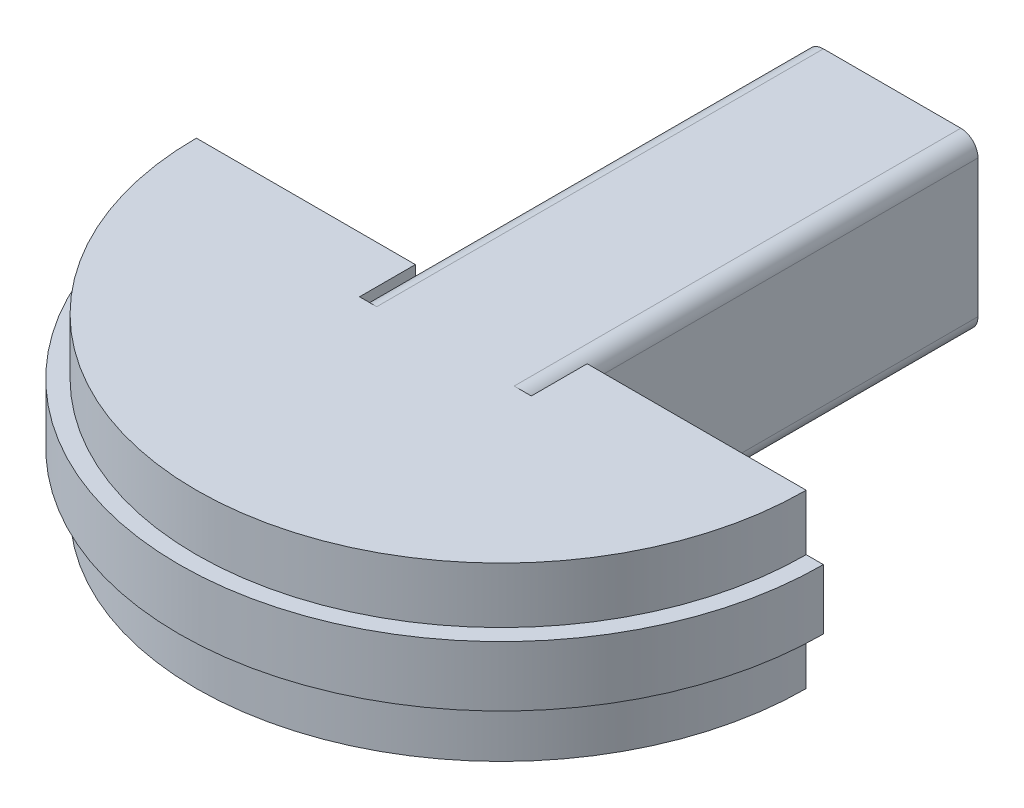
ISO-10303-21;
HEADER;
FILE_DESCRIPTION(('STEP AP214'),'2;1');
FILE_NAME('part.step','',(''),(''),'','','');
FILE_SCHEMA(('AUTOMOTIVE_DESIGN { 1 0 10303 214 1 1 1 1 }'));
ENDSEC;
DATA;
#1=APPLICATION_CONTEXT('core data for automotive mechanical design processes');
#2=APPLICATION_PROTOCOL_DEFINITION('international standard','automotive_design',2000,#1);
#3=PRODUCT_CONTEXT('',#1,'mechanical');
#4=PRODUCT('Part','Part','',(#3));
#5=PRODUCT_RELATED_PRODUCT_CATEGORY('part','',(#4));
#6=PRODUCT_DEFINITION_FORMATION('','',#4);
#7=PRODUCT_DEFINITION_CONTEXT('part definition',#1,'design');
#8=PRODUCT_DEFINITION('design','',#6,#7);
#9=PRODUCT_DEFINITION_SHAPE('','',#8);
#10=(LENGTH_UNIT() NAMED_UNIT(*) SI_UNIT(.MILLI.,.METRE.));
#11=(NAMED_UNIT(*) PLANE_ANGLE_UNIT() SI_UNIT($,.RADIAN.));
#12=(NAMED_UNIT(*) SI_UNIT($,.STERADIAN.) SOLID_ANGLE_UNIT());
#13=UNCERTAINTY_MEASURE_WITH_UNIT(LENGTH_MEASURE(1.E-05),#10,'distance_accuracy_value','');
#14=(GEOMETRIC_REPRESENTATION_CONTEXT(3) GLOBAL_UNCERTAINTY_ASSIGNED_CONTEXT((#13)) GLOBAL_UNIT_ASSIGNED_CONTEXT((#10,
#11,#12)) REPRESENTATION_CONTEXT('',''));
#15=CARTESIAN_POINT('',(0.,0.,0.));
#16=DIRECTION('',(0.,0.,1.));
#17=DIRECTION('',(1.,0.,0.));
#18=AXIS2_PLACEMENT_3D('',#15,#16,#17);
#19=CARTESIAN_POINT('',(0.,10.,45.5));
#20=DIRECTION('',(0.,-1.,0.));
#21=DIRECTION('',(0.,0.,1.));
#22=AXIS2_PLACEMENT_3D('',#19,#20,#21);
#23=CYLINDRICAL_SURFACE('',#22,35.5);
#24=CARTESIAN_POINT('',(0.,-3.5,45.5));
#25=DIRECTION('',(0.,-1.,0.));
#26=DIRECTION('',(0.,0.,-1.));
#27=AXIS2_PLACEMENT_3D('',#24,#25,#26);
#28=CIRCLE('',#27,35.5);
#29=CARTESIAN_POINT('',(35.5,-3.5,45.5));
#30=VERTEX_POINT('',#29);
#31=CARTESIAN_POINT('',(-35.5,-3.5,45.5));
#32=VERTEX_POINT('',#31);
#33=EDGE_CURVE('E29',#30,#32,#28,.T.);
#34=ORIENTED_EDGE('',*,*,#33,.T.);
#35=DIRECTION('',(0.,-1.,0.));
#36=VECTOR('',#35,1.);
#37=CARTESIAN_POINT('',(-35.5,10.,45.5));
#38=LINE('',#37,#36);
#39=CARTESIAN_POINT('',(-35.5,-10.,45.5));
#40=VERTEX_POINT('',#39);
#41=EDGE_CURVE('E259',#32,#40,#38,.T.);
#42=ORIENTED_EDGE('',*,*,#41,.T.);
#43=CARTESIAN_POINT('',(0.,-10.,45.5));
#44=DIRECTION('',(0.,1.,0.));
#45=DIRECTION('',(0.,0.,-1.));
#46=AXIS2_PLACEMENT_3D('',#43,#44,#45);
#47=CIRCLE('',#46,35.5);
#48=CARTESIAN_POINT('',(35.5,-10.,45.5));
#49=VERTEX_POINT('',#48);
#50=EDGE_CURVE('E232',#40,#49,#47,.T.);
#51=ORIENTED_EDGE('',*,*,#50,.T.);
#52=DIRECTION('',(0.,-1.,0.));
#53=VECTOR('',#52,1.);
#54=CARTESIAN_POINT('',(35.5,10.,45.5));
#55=LINE('',#54,#53);
#56=EDGE_CURVE('E255',#30,#49,#55,.T.);
#57=ORIENTED_EDGE('',*,*,#56,.F.);
#58=EDGE_LOOP('',(#34,#42,#51,#57));
#59=FACE_BOUND('',#58,.T.);
#60=ADVANCED_FACE('F14',(#59),#23,.T.);
#61=CARTESIAN_POINT('',(10.,-10.,52.));
#62=DIRECTION('',(-1.,0.,0.));
#63=DIRECTION('',(0.,0.,1.));
#64=AXIS2_PLACEMENT_3D('',#61,#62,#63);
#65=PLANE('',#64);
#66=DIRECTION('',(0.,-1.,0.));
#67=VECTOR('',#66,1.);
#68=CARTESIAN_POINT('',(10.,10.,45.5));
#69=LINE('',#68,#67);
#70=CARTESIAN_POINT('',(10.,8.,45.5));
#71=VERTEX_POINT('',#70);
#72=CARTESIAN_POINT('',(10.,-8.,45.5));
#73=VERTEX_POINT('',#72);
#74=EDGE_CURVE('E37',#71,#73,#69,.T.);
#75=ORIENTED_EDGE('',*,*,#74,.T.);
#76=DIRECTION('',(0.,0.,-1.));
#77=VECTOR('',#76,1.);
#78=CARTESIAN_POINT('',(10.,-8.,52.));
#79=LINE('',#78,#77);
#80=CARTESIAN_POINT('',(10.,-8.,0.));
#81=VERTEX_POINT('',#80);
#82=EDGE_CURVE('E157',#73,#81,#79,.T.);
#83=ORIENTED_EDGE('',*,*,#82,.T.);
#84=DIRECTION('',(0.,-1.,0.));
#85=VECTOR('',#84,1.);
#86=CARTESIAN_POINT('',(10.,8.,0.));
#87=LINE('',#86,#85);
#88=CARTESIAN_POINT('',(10.,8.,0.));
#89=VERTEX_POINT('',#88);
#90=EDGE_CURVE('E160',#89,#81,#87,.T.);
#91=ORIENTED_EDGE('',*,*,#90,.F.);
#92=DIRECTION('',(0.,0.,-1.));
#93=VECTOR('',#92,1.);
#94=CARTESIAN_POINT('',(10.,8.,52.));
#95=LINE('',#94,#93);
#96=EDGE_CURVE('E151',#89,#71,#95,.F.);
#97=ORIENTED_EDGE('',*,*,#96,.T.);
#98=EDGE_LOOP('',(#75,#83,#91,#97));
#99=FACE_BOUND('',#98,.T.);
#100=ADVANCED_FACE('F161',(#99),#65,.F.);
#101=CARTESIAN_POINT('',(-10.,-10.,52.));
#102=DIRECTION('',(1.,0.,0.));
#103=DIRECTION('',(0.,0.,-1.));
#104=AXIS2_PLACEMENT_3D('',#101,#102,#103);
#105=PLANE('',#104);
#106=DIRECTION('',(0.,-1.,0.));
#107=VECTOR('',#106,1.);
#108=CARTESIAN_POINT('',(-10.,10.,45.5));
#109=LINE('',#108,#107);
#110=CARTESIAN_POINT('',(-10.,8.,45.5));
#111=VERTEX_POINT('',#110);
#112=CARTESIAN_POINT('',(-10.,-8.,45.5));
#113=VERTEX_POINT('',#112);
#114=EDGE_CURVE('E268',#111,#113,#109,.T.);
#115=ORIENTED_EDGE('',*,*,#114,.F.);
#116=DIRECTION('',(0.,0.,-1.));
#117=VECTOR('',#116,1.);
#118=CARTESIAN_POINT('',(-10.,8.,52.));
#119=LINE('',#118,#117);
#120=CARTESIAN_POINT('',(-10.,8.,0.));
#121=VERTEX_POINT('',#120);
#122=EDGE_CURVE('E290',#111,#121,#119,.T.);
#123=ORIENTED_EDGE('',*,*,#122,.T.);
#124=DIRECTION('',(0.,1.,0.));
#125=VECTOR('',#124,1.);
#126=CARTESIAN_POINT('',(-10.,-8.,0.));
#127=LINE('',#126,#125);
#128=CARTESIAN_POINT('',(-10.,-8.,0.));
#129=VERTEX_POINT('',#128);
#130=EDGE_CURVE('E181',#129,#121,#127,.T.);
#131=ORIENTED_EDGE('',*,*,#130,.F.);
#132=DIRECTION('',(0.,0.,-1.));
#133=VECTOR('',#132,1.);
#134=CARTESIAN_POINT('',(-10.,-8.,52.));
#135=LINE('',#134,#133);
#136=EDGE_CURVE('E294',#129,#113,#135,.F.);
#137=ORIENTED_EDGE('',*,*,#136,.T.);
#138=EDGE_LOOP('',(#115,#123,#131,#137));
#139=FACE_BOUND('',#138,.T.);
#140=ADVANCED_FACE('F341',(#139),#105,.F.);
#141=CARTESIAN_POINT('',(10.,10.,52.));
#142=DIRECTION('',(0.,-1.,0.));
#143=DIRECTION('',(0.,0.,1.));
#144=AXIS2_PLACEMENT_3D('',#141,#142,#143);
#145=PLANE('',#144);
#146=DIRECTION('',(0.,0.,-1.));
#147=VECTOR('',#146,1.);
#148=CARTESIAN_POINT('',(8.,10.,52.));
#149=LINE('',#148,#147);
#150=CARTESIAN_POINT('',(8.,10.,52.));
#151=VERTEX_POINT('',#150);
#152=CARTESIAN_POINT('',(8.,10.,0.));
#153=VERTEX_POINT('',#152);
#154=EDGE_CURVE('E22',#151,#153,#149,.T.);
#155=ORIENTED_EDGE('',*,*,#154,.T.);
#156=DIRECTION('',(1.,0.,0.));
#157=VECTOR('',#156,1.);
#158=CARTESIAN_POINT('',(-8.,10.,0.));
#159=LINE('',#158,#157);
#160=CARTESIAN_POINT('',(-8.,10.,0.));
#161=VERTEX_POINT('',#160);
#162=EDGE_CURVE('E171',#161,#153,#159,.T.);
#163=ORIENTED_EDGE('',*,*,#162,.F.);
#164=DIRECTION('',(0.,0.,-1.));
#165=VECTOR('',#164,1.);
#166=CARTESIAN_POINT('',(-8.,10.,52.));
#167=LINE('',#166,#165);
#168=CARTESIAN_POINT('',(-8.,10.,52.));
#169=VERTEX_POINT('',#168);
#170=EDGE_CURVE('E9',#161,#169,#167,.F.);
#171=ORIENTED_EDGE('',*,*,#170,.T.);
#172=DIRECTION('',(-1.,0.,0.));
#173=VECTOR('',#172,1.);
#174=CARTESIAN_POINT('',(10.,10.,52.));
#175=LINE('',#174,#173);
#176=CARTESIAN_POINT('',(-10.,10.,52.));
#177=VERTEX_POINT('',#176);
#178=EDGE_CURVE('E222',#169,#177,#175,.T.);
#179=ORIENTED_EDGE('',*,*,#178,.T.);
#180=DIRECTION('',(0.,0.,-1.));
#181=VECTOR('',#180,1.);
#182=CARTESIAN_POINT('',(-10.,10.,52.));
#183=LINE('',#182,#181);
#184=CARTESIAN_POINT('',(-10.,10.,45.5));
#185=VERTEX_POINT('',#184);
#186=EDGE_CURVE('E210',#177,#185,#183,.T.);
#187=ORIENTED_EDGE('',*,*,#186,.T.);
#188=DIRECTION('',(-1.,0.,0.));
#189=VECTOR('',#188,1.);
#190=CARTESIAN_POINT('',(-10.,10.,45.5));
#191=LINE('',#190,#189);
#192=CARTESIAN_POINT('',(-35.5,10.,45.5));
#193=VERTEX_POINT('',#192);
#194=EDGE_CURVE('E213',#185,#193,#191,.T.);
#195=ORIENTED_EDGE('',*,*,#194,.T.);
#196=CARTESIAN_POINT('',(0.,10.,45.5));
#197=DIRECTION('',(0.,1.,0.));
#198=DIRECTION('',(0.,0.,-1.));
#199=AXIS2_PLACEMENT_3D('',#196,#197,#198);
#200=CIRCLE('',#199,35.5);
#201=CARTESIAN_POINT('',(35.5,10.,45.5));
#202=VERTEX_POINT('',#201);
#203=EDGE_CURVE('E216',#193,#202,#200,.T.);
#204=ORIENTED_EDGE('',*,*,#203,.T.);
#205=DIRECTION('',(-1.,0.,0.));
#206=VECTOR('',#205,1.);
#207=CARTESIAN_POINT('',(10.,10.,45.5));
#208=LINE('',#207,#206);
#209=CARTESIAN_POINT('',(10.,10.,45.5));
#210=VERTEX_POINT('',#209);
#211=EDGE_CURVE('E218',#202,#210,#208,.T.);
#212=ORIENTED_EDGE('',*,*,#211,.T.);
#213=DIRECTION('',(0.,0.,1.));
#214=VECTOR('',#213,1.);
#215=CARTESIAN_POINT('',(10.,10.,52.));
#216=LINE('',#215,#214);
#217=CARTESIAN_POINT('',(10.,10.,52.));
#218=VERTEX_POINT('',#217);
#219=EDGE_CURVE('E220',#210,#218,#216,.T.);
#220=ORIENTED_EDGE('',*,*,#219,.T.);
#221=EDGE_CURVE('E223',#218,#151,#175,.T.);
#222=ORIENTED_EDGE('',*,*,#221,.T.);
#223=EDGE_LOOP('',(#155,#163,#171,#179,#187,#195,#204,#212,#220,#222));
#224=FACE_BOUND('',#223,.T.);
#225=ADVANCED_FACE('F297',(#224),#145,.F.);
#226=CARTESIAN_POINT('',(10.,-10.,52.));
#227=DIRECTION('',(0.,1.,0.));
#228=DIRECTION('',(1.,0.,0.));
#229=AXIS2_PLACEMENT_3D('',#226,#227,#228);
#230=PLANE('',#229);
#231=DIRECTION('',(0.,0.,-1.));
#232=VECTOR('',#231,1.);
#233=CARTESIAN_POINT('',(-8.,-10.,52.));
#234=LINE('',#233,#232);
#235=CARTESIAN_POINT('',(-8.,-10.,52.));
#236=VERTEX_POINT('',#235);
#237=CARTESIAN_POINT('',(-8.,-10.,0.));
#238=VERTEX_POINT('',#237);
#239=EDGE_CURVE('E274',#236,#238,#234,.T.);
#240=ORIENTED_EDGE('',*,*,#239,.T.);
#241=DIRECTION('',(-1.,0.,0.));
#242=VECTOR('',#241,1.);
#243=CARTESIAN_POINT('',(8.,-10.,0.));
#244=LINE('',#243,#242);
#245=CARTESIAN_POINT('',(8.,-10.,0.));
#246=VERTEX_POINT('',#245);
#247=EDGE_CURVE('E175',#246,#238,#244,.T.);
#248=ORIENTED_EDGE('',*,*,#247,.F.);
#249=DIRECTION('',(0.,0.,-1.));
#250=VECTOR('',#249,1.);
#251=CARTESIAN_POINT('',(8.,-10.,52.));
#252=LINE('',#251,#250);
#253=CARTESIAN_POINT('',(8.,-10.,52.));
#254=VERTEX_POINT('',#253);
#255=EDGE_CURVE('E276',#246,#254,#252,.F.);
#256=ORIENTED_EDGE('',*,*,#255,.T.);
#257=DIRECTION('',(-1.,0.,0.));
#258=VECTOR('',#257,1.);
#259=CARTESIAN_POINT('',(10.,-10.,52.));
#260=LINE('',#259,#258);
#261=CARTESIAN_POINT('',(10.,-10.,52.));
#262=VERTEX_POINT('',#261);
#263=EDGE_CURVE('E214',#262,#254,#260,.T.);
#264=ORIENTED_EDGE('',*,*,#263,.F.);
#265=DIRECTION('',(0.,0.,1.));
#266=VECTOR('',#265,1.);
#267=CARTESIAN_POINT('',(10.,-10.,52.));
#268=LINE('',#267,#266);
#269=CARTESIAN_POINT('',(10.,-10.,45.5));
#270=VERTEX_POINT('',#269);
#271=EDGE_CURVE('E238',#270,#262,#268,.T.);
#272=ORIENTED_EDGE('',*,*,#271,.F.);
#273=DIRECTION('',(-1.,0.,0.));
#274=VECTOR('',#273,1.);
#275=CARTESIAN_POINT('',(10.,-10.,45.5));
#276=LINE('',#275,#274);
#277=EDGE_CURVE('E235',#49,#270,#276,.T.);
#278=ORIENTED_EDGE('',*,*,#277,.F.);
#279=ORIENTED_EDGE('',*,*,#50,.F.);
#280=DIRECTION('',(-1.,0.,0.));
#281=VECTOR('',#280,1.);
#282=CARTESIAN_POINT('',(-10.,-10.,45.5));
#283=LINE('',#282,#281);
#284=CARTESIAN_POINT('',(-10.,-10.,45.5));
#285=VERTEX_POINT('',#284);
#286=EDGE_CURVE('E229',#285,#40,#283,.T.);
#287=ORIENTED_EDGE('',*,*,#286,.F.);
#288=DIRECTION('',(0.,0.,-1.));
#289=VECTOR('',#288,1.);
#290=CARTESIAN_POINT('',(-10.,-10.,52.));
#291=LINE('',#290,#289);
#292=CARTESIAN_POINT('',(-10.,-10.,52.));
#293=VERTEX_POINT('',#292);
#294=EDGE_CURVE('E209',#293,#285,#291,.T.);
#295=ORIENTED_EDGE('',*,*,#294,.F.);
#296=EDGE_CURVE('E241',#236,#293,#260,.T.);
#297=ORIENTED_EDGE('',*,*,#296,.F.);
#298=EDGE_LOOP('',(#240,#248,#256,#264,#272,#278,#279,#287,#295,#297));
#299=FACE_BOUND('',#298,.T.);
#300=ADVANCED_FACE('F319',(#299),#230,.F.);
#301=CARTESIAN_POINT('',(8.,-8.,52.));
#302=DIRECTION('',(0.,0.,-1.));
#303=DIRECTION('',(-1.,0.,0.));
#304=AXIS2_PLACEMENT_3D('',#301,#302,#303);
#305=CYLINDRICAL_SURFACE('',#304,2.);
#306=CARTESIAN_POINT('',(8.,-8.,52.));
#307=DIRECTION('',(0.,0.,1.));
#308=DIRECTION('',(1.,0.,0.));
#309=AXIS2_PLACEMENT_3D('',#306,#307,#308);
#310=CIRCLE('',#309,2.);
#311=CARTESIAN_POINT('',(10.,-8.,52.));
#312=VERTEX_POINT('',#311);
#313=EDGE_CURVE('E287',#254,#312,#310,.T.);
#314=ORIENTED_EDGE('',*,*,#313,.F.);
#315=ORIENTED_EDGE('',*,*,#255,.F.);
#316=CARTESIAN_POINT('',(8.,-8.,0.));
#317=DIRECTION('',(0.,0.,-1.));
#318=DIRECTION('',(-1.,0.,0.));
#319=AXIS2_PLACEMENT_3D('',#316,#317,#318);
#320=CIRCLE('',#319,2.);
#321=EDGE_CURVE('E165',#81,#246,#320,.T.);
#322=ORIENTED_EDGE('',*,*,#321,.F.);
#323=ORIENTED_EDGE('',*,*,#82,.F.);
#324=EDGE_CURVE('E271',#312,#73,#79,.T.);
#325=ORIENTED_EDGE('',*,*,#324,.F.);
#326=EDGE_LOOP('',(#314,#315,#322,#323,#325));
#327=FACE_BOUND('',#326,.T.);
#328=ADVANCED_FACE('F325',(#327),#305,.T.);
#329=CARTESIAN_POINT('',(-8.,-8.,52.));
#330=DIRECTION('',(0.,0.,-1.));
#331=DIRECTION('',(-1.,0.,0.));
#332=AXIS2_PLACEMENT_3D('',#329,#330,#331);
#333=CYLINDRICAL_SURFACE('',#332,2.);
#334=CARTESIAN_POINT('',(-8.,-8.,52.));
#335=DIRECTION('',(0.,0.,1.));
#336=DIRECTION('',(1.,0.,0.));
#337=AXIS2_PLACEMENT_3D('',#334,#335,#336);
#338=CIRCLE('',#337,2.);
#339=CARTESIAN_POINT('',(-10.,-8.,52.));
#340=VERTEX_POINT('',#339);
#341=EDGE_CURVE('E284',#340,#236,#338,.T.);
#342=ORIENTED_EDGE('',*,*,#341,.F.);
#343=DIRECTION('',(0.,0.,-1.));
#344=VECTOR('',#343,1.);
#345=CARTESIAN_POINT('',(-10.,-8.,52.));
#346=LINE('',#345,#344);
#347=EDGE_CURVE('E267',#113,#340,#346,.F.);
#348=ORIENTED_EDGE('',*,*,#347,.F.);
#349=ORIENTED_EDGE('',*,*,#136,.F.);
#350=CARTESIAN_POINT('',(-8.,-8.,0.));
#351=DIRECTION('',(0.,0.,-1.));
#352=DIRECTION('',(-1.,0.,0.));
#353=AXIS2_PLACEMENT_3D('',#350,#351,#352);
#354=CIRCLE('',#353,2.);
#355=EDGE_CURVE('E178',#238,#129,#354,.T.);
#356=ORIENTED_EDGE('',*,*,#355,.F.);
#357=ORIENTED_EDGE('',*,*,#239,.F.);
#358=EDGE_LOOP('',(#342,#348,#349,#356,#357));
#359=FACE_BOUND('',#358,.T.);
#360=ADVANCED_FACE('F331',(#359),#333,.T.);
#361=CARTESIAN_POINT('',(-8.,8.,52.));
#362=DIRECTION('',(0.,0.,-1.));
#363=DIRECTION('',(-1.,0.,0.));
#364=AXIS2_PLACEMENT_3D('',#361,#362,#363);
#365=CYLINDRICAL_SURFACE('',#364,2.);
#366=CARTESIAN_POINT('',(-8.,8.,52.));
#367=DIRECTION('',(0.,0.,1.));
#368=DIRECTION('',(1.,0.,0.));
#369=AXIS2_PLACEMENT_3D('',#366,#367,#368);
#370=CIRCLE('',#369,2.);
#371=CARTESIAN_POINT('',(-10.,8.,52.));
#372=VERTEX_POINT('',#371);
#373=EDGE_CURVE('E281',#169,#372,#370,.T.);
#374=ORIENTED_EDGE('',*,*,#373,.F.);
#375=ORIENTED_EDGE('',*,*,#170,.F.);
#376=CARTESIAN_POINT('',(-8.,8.,0.));
#377=DIRECTION('',(0.,0.,-1.));
#378=DIRECTION('',(-1.,0.,0.));
#379=AXIS2_PLACEMENT_3D('',#376,#377,#378);
#380=CIRCLE('',#379,2.);
#381=EDGE_CURVE('E184',#121,#161,#380,.T.);
#382=ORIENTED_EDGE('',*,*,#381,.F.);
#383=ORIENTED_EDGE('',*,*,#122,.F.);
#384=EDGE_CURVE('E291',#372,#111,#119,.T.);
#385=ORIENTED_EDGE('',*,*,#384,.F.);
#386=EDGE_LOOP('',(#374,#375,#382,#383,#385));
#387=FACE_BOUND('',#386,.T.);
#388=ADVANCED_FACE('F346',(#387),#365,.T.);
#389=CARTESIAN_POINT('',(8.,8.,52.));
#390=DIRECTION('',(0.,0.,-1.));
#391=DIRECTION('',(-1.,0.,0.));
#392=AXIS2_PLACEMENT_3D('',#389,#390,#391);
#393=CYLINDRICAL_SURFACE('',#392,2.);
#394=CARTESIAN_POINT('',(8.,8.,52.));
#395=DIRECTION('',(0.,0.,1.));
#396=DIRECTION('',(1.,0.,0.));
#397=AXIS2_PLACEMENT_3D('',#394,#395,#396);
#398=CIRCLE('',#397,2.);
#399=CARTESIAN_POINT('',(10.,8.,52.));
#400=VERTEX_POINT('',#399);
#401=EDGE_CURVE('E278',#400,#151,#398,.T.);
#402=ORIENTED_EDGE('',*,*,#401,.F.);
#403=EDGE_CURVE('E156',#71,#400,#95,.F.);
#404=ORIENTED_EDGE('',*,*,#403,.F.);
#405=ORIENTED_EDGE('',*,*,#96,.F.);
#406=CARTESIAN_POINT('',(8.,8.,0.));
#407=DIRECTION('',(0.,0.,-1.));
#408=DIRECTION('',(-1.,0.,0.));
#409=AXIS2_PLACEMENT_3D('',#406,#407,#408);
#410=CIRCLE('',#409,2.);
#411=EDGE_CURVE('E154',#153,#89,#410,.T.);
#412=ORIENTED_EDGE('',*,*,#411,.F.);
#413=ORIENTED_EDGE('',*,*,#154,.F.);
#414=EDGE_LOOP('',(#402,#404,#405,#412,#413));
#415=FACE_BOUND('',#414,.T.);
#416=ADVANCED_FACE('F16',(#415),#393,.T.);
#417=CARTESIAN_POINT('',(-10.,10.,52.));
#418=DIRECTION('',(-1.,0.,0.));
#419=DIRECTION('',(0.,0.,1.));
#420=AXIS2_PLACEMENT_3D('',#417,#418,#419);
#421=PLANE('',#420);
#422=EDGE_CURVE('E263',#113,#285,#109,.T.);
#423=ORIENTED_EDGE('',*,*,#422,.F.);
#424=ORIENTED_EDGE('',*,*,#347,.T.);
#425=DIRECTION('',(0.,-1.,0.));
#426=VECTOR('',#425,1.);
#427=CARTESIAN_POINT('',(-10.,10.,52.));
#428=LINE('',#427,#426);
#429=EDGE_CURVE('E226',#340,#293,#428,.T.);
#430=ORIENTED_EDGE('',*,*,#429,.T.);
#431=ORIENTED_EDGE('',*,*,#294,.T.);
#432=EDGE_LOOP('',(#423,#424,#430,#431));
#433=FACE_BOUND('',#432,.T.);
#434=ADVANCED_FACE('F337',(#433),#421,.F.);
#435=CARTESIAN_POINT('',(10.,10.,52.));
#436=DIRECTION('',(1.,0.,0.));
#437=DIRECTION('',(0.,0.,-1.));
#438=AXIS2_PLACEMENT_3D('',#435,#436,#437);
#439=PLANE('',#438);
#440=EDGE_CURVE('E252',#210,#71,#69,.T.);
#441=ORIENTED_EDGE('',*,*,#440,.T.);
#442=ORIENTED_EDGE('',*,*,#403,.T.);
#443=DIRECTION('',(0.,-1.,0.));
#444=VECTOR('',#443,1.);
#445=CARTESIAN_POINT('',(10.,10.,52.));
#446=LINE('',#445,#444);
#447=EDGE_CURVE('E248',#218,#400,#446,.T.);
#448=ORIENTED_EDGE('',*,*,#447,.F.);
#449=ORIENTED_EDGE('',*,*,#219,.F.);
#450=EDGE_LOOP('',(#441,#442,#448,#449));
#451=FACE_BOUND('',#450,.T.);
#452=ADVANCED_FACE('F304',(#451),#439,.F.);
#453=CARTESIAN_POINT('',(10.,10.,52.));
#454=DIRECTION('',(0.,0.,1.));
#455=DIRECTION('',(1.,0.,0.));
#456=AXIS2_PLACEMENT_3D('',#453,#454,#455);
#457=PLANE('',#456);
#458=ORIENTED_EDGE('',*,*,#313,.T.);
#459=EDGE_CURVE('E247',#312,#262,#446,.T.);
#460=ORIENTED_EDGE('',*,*,#459,.T.);
#461=ORIENTED_EDGE('',*,*,#263,.T.);
#462=EDGE_LOOP('',(#458,#460,#461));
#463=FACE_BOUND('',#462,.T.);
#464=ADVANCED_FACE('F323',(#463),#457,.F.);
#465=ORIENTED_EDGE('',*,*,#341,.T.);
#466=ORIENTED_EDGE('',*,*,#296,.T.);
#467=ORIENTED_EDGE('',*,*,#429,.F.);
#468=EDGE_LOOP('',(#465,#466,#467));
#469=FACE_BOUND('',#468,.T.);
#470=ADVANCED_FACE('F334',(#469),#457,.F.);
#471=ORIENTED_EDGE('',*,*,#373,.T.);
#472=EDGE_CURVE('E244',#177,#372,#428,.T.);
#473=ORIENTED_EDGE('',*,*,#472,.F.);
#474=ORIENTED_EDGE('',*,*,#178,.F.);
#475=EDGE_LOOP('',(#471,#473,#474));
#476=FACE_BOUND('',#475,.T.);
#477=ADVANCED_FACE('F352',(#476),#457,.F.);
#478=ORIENTED_EDGE('',*,*,#384,.T.);
#479=EDGE_CURVE('E264',#185,#111,#109,.T.);
#480=ORIENTED_EDGE('',*,*,#479,.F.);
#481=ORIENTED_EDGE('',*,*,#186,.F.);
#482=ORIENTED_EDGE('',*,*,#472,.T.);
#483=EDGE_LOOP('',(#478,#480,#481,#482));
#484=FACE_BOUND('',#483,.T.);
#485=ADVANCED_FACE('F354',(#484),#421,.F.);
#486=CARTESIAN_POINT('',(-10.,10.,45.5));
#487=DIRECTION('',(0.,0.,1.));
#488=DIRECTION('',(1.,0.,0.));
#489=AXIS2_PLACEMENT_3D('',#486,#487,#488);
#490=PLANE('',#489);
#491=ORIENTED_EDGE('',*,*,#286,.T.);
#492=ORIENTED_EDGE('',*,*,#41,.F.);
#493=DIRECTION('',(-1.,0.,0.));
#494=VECTOR('',#493,1.);
#495=CARTESIAN_POINT('',(-35.5,-3.5,45.5));
#496=LINE('',#495,#494);
#497=CARTESIAN_POINT('',(-37.5,-3.5,45.5));
#498=VERTEX_POINT('',#497);
#499=EDGE_CURVE('E199',#32,#498,#496,.T.);
#500=ORIENTED_EDGE('',*,*,#499,.T.);
#501=DIRECTION('',(0.,-1.,0.));
#502=VECTOR('',#501,1.);
#503=CARTESIAN_POINT('',(-37.5,3.5,45.5));
#504=LINE('',#503,#502);
#505=CARTESIAN_POINT('',(-37.5,3.5,45.5));
#506=VERTEX_POINT('',#505);
#507=EDGE_CURVE('E206',#506,#498,#504,.T.);
#508=ORIENTED_EDGE('',*,*,#507,.F.);
#509=DIRECTION('',(-1.,0.,0.));
#510=VECTOR('',#509,1.);
#511=CARTESIAN_POINT('',(-35.5,3.5,45.5));
#512=LINE('',#511,#510);
#513=CARTESIAN_POINT('',(-35.5,3.5,45.5));
#514=VERTEX_POINT('',#513);
#515=EDGE_CURVE('E190',#514,#506,#512,.T.);
#516=ORIENTED_EDGE('',*,*,#515,.F.);
#517=EDGE_CURVE('E260',#193,#514,#38,.T.);
#518=ORIENTED_EDGE('',*,*,#517,.F.);
#519=ORIENTED_EDGE('',*,*,#194,.F.);
#520=ORIENTED_EDGE('',*,*,#479,.T.);
#521=ORIENTED_EDGE('',*,*,#114,.T.);
#522=ORIENTED_EDGE('',*,*,#422,.T.);
#523=EDGE_LOOP('',(#491,#492,#500,#508,#516,#518,#519,#520,#521,#522));
#524=FACE_BOUND('',#523,.T.);
#525=ADVANCED_FACE('F356',(#524),#490,.F.);
#526=ORIENTED_EDGE('',*,*,#517,.T.);
#527=CARTESIAN_POINT('',(0.,3.5,45.5));
#528=DIRECTION('',(0.,-1.,0.));
#529=DIRECTION('',(0.,0.,-1.));
#530=AXIS2_PLACEMENT_3D('',#527,#528,#529);
#531=CIRCLE('',#530,35.5);
#532=CARTESIAN_POINT('',(35.5,3.5,45.5));
#533=VERTEX_POINT('',#532);
#534=EDGE_CURVE('E187',#533,#514,#531,.T.);
#535=ORIENTED_EDGE('',*,*,#534,.F.);
#536=EDGE_CURVE('E256',#202,#533,#55,.T.);
#537=ORIENTED_EDGE('',*,*,#536,.F.);
#538=ORIENTED_EDGE('',*,*,#203,.F.);
#539=EDGE_LOOP('',(#526,#535,#537,#538));
#540=FACE_BOUND('',#539,.T.);
#541=ADVANCED_FACE('F362',(#540),#23,.T.);
#542=CARTESIAN_POINT('',(10.,10.,45.5));
#543=DIRECTION('',(0.,0.,1.));
#544=DIRECTION('',(1.,0.,0.));
#545=AXIS2_PLACEMENT_3D('',#542,#543,#544);
#546=PLANE('',#545);
#547=ORIENTED_EDGE('',*,*,#277,.T.);
#548=EDGE_CURVE('E251',#73,#270,#69,.T.);
#549=ORIENTED_EDGE('',*,*,#548,.F.);
#550=ORIENTED_EDGE('',*,*,#74,.F.);
#551=ORIENTED_EDGE('',*,*,#440,.F.);
#552=ORIENTED_EDGE('',*,*,#211,.F.);
#553=ORIENTED_EDGE('',*,*,#536,.T.);
#554=DIRECTION('',(-1.,0.,0.));
#555=VECTOR('',#554,1.);
#556=CARTESIAN_POINT('',(35.5,3.5,45.5));
#557=LINE('',#556,#555);
#558=CARTESIAN_POINT('',(37.5,3.5,45.5));
#559=VERTEX_POINT('',#558);
#560=EDGE_CURVE('E195',#559,#533,#557,.T.);
#561=ORIENTED_EDGE('',*,*,#560,.F.);
#562=DIRECTION('',(0.,-1.,0.));
#563=VECTOR('',#562,1.);
#564=CARTESIAN_POINT('',(37.5,3.5,45.5));
#565=LINE('',#564,#563);
#566=CARTESIAN_POINT('',(37.5,-3.5,45.5));
#567=VERTEX_POINT('',#566);
#568=EDGE_CURVE('E197',#559,#567,#565,.T.);
#569=ORIENTED_EDGE('',*,*,#568,.T.);
#570=DIRECTION('',(-1.,0.,0.));
#571=VECTOR('',#570,1.);
#572=CARTESIAN_POINT('',(35.5,-3.5,45.5));
#573=LINE('',#572,#571);
#574=EDGE_CURVE('E191',#567,#30,#573,.T.);
#575=ORIENTED_EDGE('',*,*,#574,.T.);
#576=ORIENTED_EDGE('',*,*,#56,.T.);
#577=EDGE_LOOP('',(#547,#549,#550,#551,#552,#553,#561,#569,#575,#576));
#578=FACE_BOUND('',#577,.T.);
#579=ADVANCED_FACE('F308',(#578),#546,.F.);
#580=ORIENTED_EDGE('',*,*,#324,.T.);
#581=ORIENTED_EDGE('',*,*,#548,.T.);
#582=ORIENTED_EDGE('',*,*,#271,.T.);
#583=ORIENTED_EDGE('',*,*,#459,.F.);
#584=EDGE_LOOP('',(#580,#581,#582,#583));
#585=FACE_BOUND('',#584,.T.);
#586=ADVANCED_FACE('F311',(#585),#439,.F.);
#587=ORIENTED_EDGE('',*,*,#401,.T.);
#588=ORIENTED_EDGE('',*,*,#221,.F.);
#589=ORIENTED_EDGE('',*,*,#447,.T.);
#590=EDGE_LOOP('',(#587,#588,#589));
#591=FACE_BOUND('',#590,.T.);
#592=ADVANCED_FACE('F300',(#591),#457,.F.);
#593=CARTESIAN_POINT('',(0.,3.5,45.5));
#594=DIRECTION('',(0.,-1.,0.));
#595=DIRECTION('',(0.,0.,1.));
#596=AXIS2_PLACEMENT_3D('',#593,#594,#595);
#597=CYLINDRICAL_SURFACE('',#596,37.5);
#598=CARTESIAN_POINT('',(0.,-3.5,45.5));
#599=DIRECTION('',(0.,1.,0.));
#600=DIRECTION('',(0.,0.,-1.));
#601=AXIS2_PLACEMENT_3D('',#598,#599,#600);
#602=CIRCLE('',#601,37.5);
#603=EDGE_CURVE('E201',#498,#567,#602,.T.);
#604=ORIENTED_EDGE('',*,*,#603,.T.);
#605=ORIENTED_EDGE('',*,*,#568,.F.);
#606=CARTESIAN_POINT('',(0.,3.5,45.5));
#607=DIRECTION('',(0.,1.,0.));
#608=DIRECTION('',(0.,0.,-1.));
#609=AXIS2_PLACEMENT_3D('',#606,#607,#608);
#610=CIRCLE('',#609,37.5);
#611=EDGE_CURVE('E193',#506,#559,#610,.T.);
#612=ORIENTED_EDGE('',*,*,#611,.F.);
#613=ORIENTED_EDGE('',*,*,#507,.T.);
#614=EDGE_LOOP('',(#604,#605,#612,#613));
#615=FACE_BOUND('',#614,.T.);
#616=ADVANCED_FACE('F370',(#615),#597,.T.);
#617=CARTESIAN_POINT('',(0.,3.5,45.5));
#618=DIRECTION('',(0.,1.,0.));
#619=DIRECTION('',(0.,0.,-1.));
#620=AXIS2_PLACEMENT_3D('',#617,#618,#619);
#621=PLANE('',#620);
#622=ORIENTED_EDGE('',*,*,#534,.T.);
#623=ORIENTED_EDGE('',*,*,#515,.T.);
#624=ORIENTED_EDGE('',*,*,#611,.T.);
#625=ORIENTED_EDGE('',*,*,#560,.T.);
#626=EDGE_LOOP('',(#622,#623,#624,#625));
#627=FACE_BOUND('',#626,.T.);
#628=ADVANCED_FACE('F366',(#627),#621,.T.);
#629=CARTESIAN_POINT('',(0.,-3.5,45.5));
#630=DIRECTION('',(0.,1.,0.));
#631=DIRECTION('',(0.,0.,-1.));
#632=AXIS2_PLACEMENT_3D('',#629,#630,#631);
#633=PLANE('',#632);
#634=ORIENTED_EDGE('',*,*,#33,.F.);
#635=ORIENTED_EDGE('',*,*,#574,.F.);
#636=ORIENTED_EDGE('',*,*,#603,.F.);
#637=ORIENTED_EDGE('',*,*,#499,.F.);
#638=EDGE_LOOP('',(#634,#635,#636,#637));
#639=FACE_BOUND('',#638,.T.);
#640=ADVANCED_FACE('F372',(#639),#633,.F.);
#641=CARTESIAN_POINT('',(8.,8.,0.));
#642=DIRECTION('',(0.,0.,-1.));
#643=DIRECTION('',(-1.,0.,0.));
#644=AXIS2_PLACEMENT_3D('',#641,#642,#643);
#645=PLANE('',#644);
#646=ORIENTED_EDGE('',*,*,#411,.T.);
#647=ORIENTED_EDGE('',*,*,#90,.T.);
#648=ORIENTED_EDGE('',*,*,#321,.T.);
#649=ORIENTED_EDGE('',*,*,#247,.T.);
#650=ORIENTED_EDGE('',*,*,#355,.T.);
#651=ORIENTED_EDGE('',*,*,#130,.T.);
#652=ORIENTED_EDGE('',*,*,#381,.T.);
#653=ORIENTED_EDGE('',*,*,#162,.T.);
#654=EDGE_LOOP('',(#646,#647,#648,#649,#650,#651,#652,#653));
#655=FACE_BOUND('',#654,.T.);
#656=ADVANCED_FACE('F168',(#655),#645,.T.);
#657=CLOSED_SHELL('',(#60,#100,#140,#225,#300,#328,#360,#388,#416,#434,#452,#464,#470,#477,#485,
#525,#541,#579,#586,#592,#616,#628,#640,#656));
#658=MANIFOLD_SOLID_BREP('B1',#657);
#659=ADVANCED_BREP_SHAPE_REPRESENTATION('',(#18,#658),#14);
#660=SHAPE_DEFINITION_REPRESENTATION(#9,#659);
ENDSEC;
END-ISO-10303-21;
